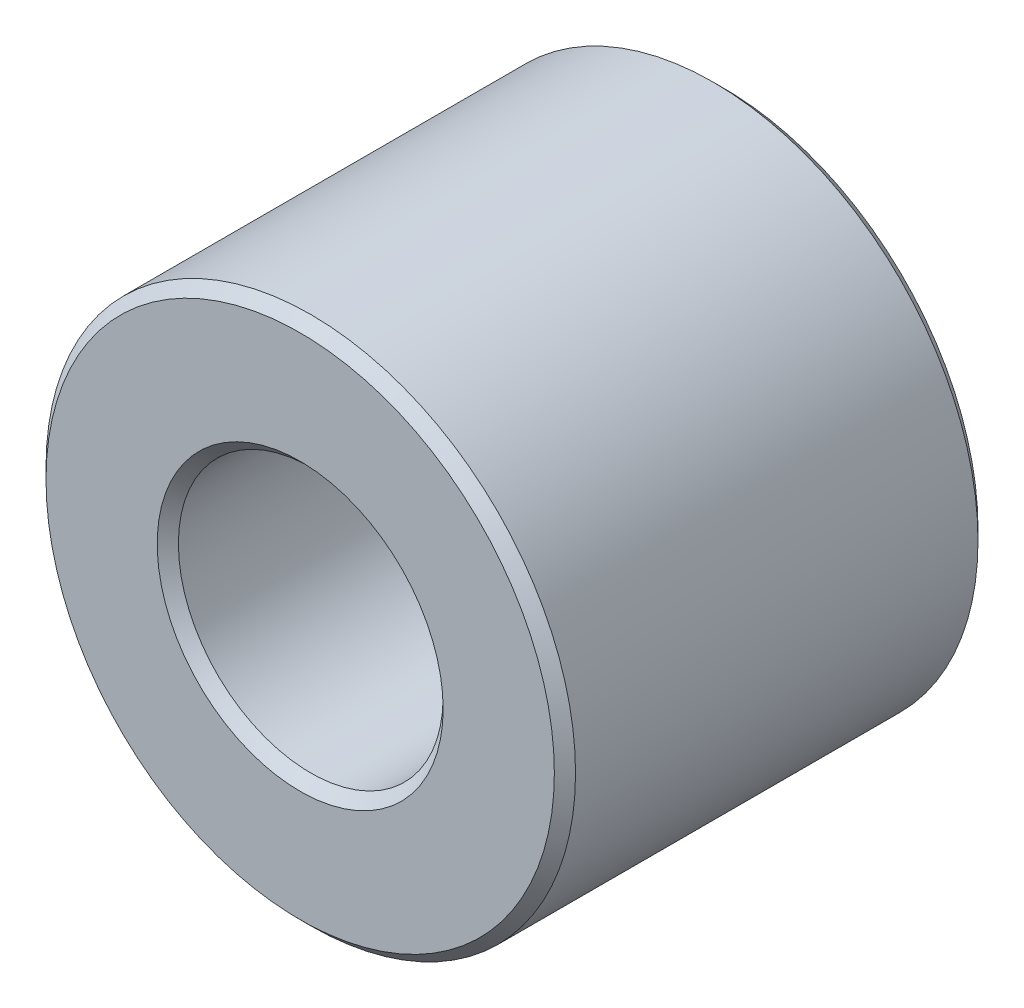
ISO-10303-21;
HEADER;
FILE_DESCRIPTION(('STEP AP214'),'2;1');
FILE_NAME('part.step','',(''),(''),'','','');
FILE_SCHEMA(('AUTOMOTIVE_DESIGN { 1 0 10303 214 1 1 1 1 }'));
ENDSEC;
DATA;
#1=APPLICATION_CONTEXT('core data for automotive mechanical design processes');
#2=APPLICATION_PROTOCOL_DEFINITION('international standard','automotive_design',2000,#1);
#3=PRODUCT_CONTEXT('',#1,'mechanical');
#4=PRODUCT('Part','Part','',(#3));
#5=PRODUCT_RELATED_PRODUCT_CATEGORY('part','',(#4));
#6=PRODUCT_DEFINITION_FORMATION('','',#4);
#7=PRODUCT_DEFINITION_CONTEXT('part definition',#1,'design');
#8=PRODUCT_DEFINITION('design','',#6,#7);
#9=PRODUCT_DEFINITION_SHAPE('','',#8);
#10=(LENGTH_UNIT() NAMED_UNIT(*) SI_UNIT(.MILLI.,.METRE.));
#11=(NAMED_UNIT(*) PLANE_ANGLE_UNIT() SI_UNIT($,.RADIAN.));
#12=(NAMED_UNIT(*) SI_UNIT($,.STERADIAN.) SOLID_ANGLE_UNIT());
#13=UNCERTAINTY_MEASURE_WITH_UNIT(LENGTH_MEASURE(1.E-05),#10,'distance_accuracy_value','');
#14=(GEOMETRIC_REPRESENTATION_CONTEXT(3) GLOBAL_UNCERTAINTY_ASSIGNED_CONTEXT((#13)) GLOBAL_UNIT_ASSIGNED_CONTEXT((#10,
#11,#12)) REPRESENTATION_CONTEXT('',''));
#15=CARTESIAN_POINT('',(0.,0.,0.));
#16=DIRECTION('',(0.,0.,1.));
#17=DIRECTION('',(1.,0.,0.));
#18=AXIS2_PLACEMENT_3D('',#15,#16,#17);
#19=CARTESIAN_POINT('',(0.,0.,2.));
#20=DIRECTION('',(0.,0.,1.));
#21=DIRECTION('',(1.,0.,0.));
#22=AXIS2_PLACEMENT_3D('',#19,#20,#21);
#23=PLANE('',#22);
#24=CARTESIAN_POINT('',(0.,0.,2.));
#25=DIRECTION('',(0.,0.,1.));
#26=DIRECTION('',(1.,0.,0.));
#27=AXIS2_PLACEMENT_3D('',#24,#25,#26);
#28=CIRCLE('',#27,1.35);
#29=CARTESIAN_POINT('',(1.35,0.,2.));
#30=VERTEX_POINT('',#29);
#31=EDGE_CURVE('E10',#30,#30,#28,.F.);
#32=ORIENTED_EDGE('',*,*,#31,.T.);
#33=EDGE_LOOP('',(#32));
#34=FACE_BOUND('',#33,.T.);
#35=CARTESIAN_POINT('',(0.,0.,2.));
#36=DIRECTION('',(0.,0.,1.));
#37=DIRECTION('',(1.,0.,0.));
#38=AXIS2_PLACEMENT_3D('',#35,#36,#37);
#39=CIRCLE('',#38,2.4);
#40=CARTESIAN_POINT('',(2.4,0.,2.));
#41=VERTEX_POINT('',#40);
#42=EDGE_CURVE('E45',#41,#41,#39,.T.);
#43=ORIENTED_EDGE('',*,*,#42,.T.);
#44=EDGE_LOOP('',(#43));
#45=FACE_BOUND('',#44,.T.);
#46=ADVANCED_FACE('F37',(#34,#45),#23,.T.);
#47=CARTESIAN_POINT('',(0.,0.,-2.));
#48=DIRECTION('',(0.,0.,1.));
#49=DIRECTION('',(1.,0.,0.));
#50=AXIS2_PLACEMENT_3D('',#47,#48,#49);
#51=PLANE('',#50);
#52=CARTESIAN_POINT('',(0.,0.,-2.));
#53=DIRECTION('',(0.,0.,1.));
#54=DIRECTION('',(1.,0.,0.));
#55=AXIS2_PLACEMENT_3D('',#52,#53,#54);
#56=CIRCLE('',#55,2.4);
#57=CARTESIAN_POINT('',(2.4,0.,-2.));
#58=VERTEX_POINT('',#57);
#59=EDGE_CURVE('E62',#58,#58,#56,.F.);
#60=ORIENTED_EDGE('',*,*,#59,.T.);
#61=EDGE_LOOP('',(#60));
#62=FACE_BOUND('',#61,.T.);
#63=CARTESIAN_POINT('',(0.,0.,-2.));
#64=DIRECTION('',(0.,0.,1.));
#65=DIRECTION('',(1.,0.,0.));
#66=AXIS2_PLACEMENT_3D('',#63,#64,#65);
#67=CIRCLE('',#66,1.35);
#68=CARTESIAN_POINT('',(1.35,0.,-2.));
#69=VERTEX_POINT('',#68);
#70=EDGE_CURVE('E66',#69,#69,#67,.T.);
#71=ORIENTED_EDGE('',*,*,#70,.T.);
#72=EDGE_LOOP('',(#71));
#73=FACE_BOUND('',#72,.T.);
#74=ADVANCED_FACE('F89',(#62,#73),#51,.F.);
#75=CARTESIAN_POINT('',(0.,0.,2.));
#76=DIRECTION('',(0.,0.,-1.));
#77=DIRECTION('',(-1.,0.,0.));
#78=AXIS2_PLACEMENT_3D('',#75,#76,#77);
#79=CYLINDRICAL_SURFACE('',#78,2.5);
#80=CARTESIAN_POINT('',(0.,0.,-1.9));
#81=DIRECTION('',(0.,0.,1.));
#82=DIRECTION('',(1.,0.,0.));
#83=AXIS2_PLACEMENT_3D('',#80,#81,#82);
#84=CIRCLE('',#83,2.5);
#85=CARTESIAN_POINT('',(2.5,0.,-1.9));
#86=VERTEX_POINT('',#85);
#87=EDGE_CURVE('E69',#86,#86,#84,.T.);
#88=ORIENTED_EDGE('',*,*,#87,.T.);
#89=EDGE_LOOP('',(#88));
#90=FACE_BOUND('',#89,.T.);
#91=CARTESIAN_POINT('',(0.,0.,1.9));
#92=DIRECTION('',(0.,0.,1.));
#93=DIRECTION('',(1.,0.,0.));
#94=AXIS2_PLACEMENT_3D('',#91,#92,#93);
#95=CIRCLE('',#94,2.5);
#96=CARTESIAN_POINT('',(2.5,0.,1.9));
#97=VERTEX_POINT('',#96);
#98=EDGE_CURVE('E73',#97,#97,#95,.F.);
#99=ORIENTED_EDGE('',*,*,#98,.T.);
#100=EDGE_LOOP('',(#99));
#101=FACE_BOUND('',#100,.T.);
#102=ADVANCED_FACE('F78',(#90,#101),#79,.T.);
#103=CARTESIAN_POINT('',(0.,0.,2.));
#104=DIRECTION('',(0.,0.,-1.));
#105=DIRECTION('',(-1.,0.,0.));
#106=AXIS2_PLACEMENT_3D('',#103,#104,#105);
#107=CYLINDRICAL_SURFACE('',#106,1.25);
#108=CARTESIAN_POINT('',(0.,0.,-1.9));
#109=DIRECTION('',(0.,0.,1.));
#110=DIRECTION('',(1.,0.,0.));
#111=AXIS2_PLACEMENT_3D('',#108,#109,#110);
#112=CIRCLE('',#111,1.25);
#113=CARTESIAN_POINT('',(1.25,0.,-1.9));
#114=VERTEX_POINT('',#113);
#115=EDGE_CURVE('E51',#114,#114,#112,.F.);
#116=ORIENTED_EDGE('',*,*,#115,.T.);
#117=EDGE_LOOP('',(#116));
#118=FACE_BOUND('',#117,.T.);
#119=CARTESIAN_POINT('',(0.,0.,1.9));
#120=DIRECTION('',(0.,0.,1.));
#121=DIRECTION('',(1.,0.,0.));
#122=AXIS2_PLACEMENT_3D('',#119,#120,#121);
#123=CIRCLE('',#122,1.25);
#124=CARTESIAN_POINT('',(1.25,0.,1.9));
#125=VERTEX_POINT('',#124);
#126=EDGE_CURVE('E57',#125,#125,#123,.T.);
#127=ORIENTED_EDGE('',*,*,#126,.T.);
#128=EDGE_LOOP('',(#127));
#129=FACE_BOUND('',#128,.T.);
#130=ADVANCED_FACE('F97',(#118,#129),#107,.F.);
#131=CARTESIAN_POINT('',(0.,0.,-1.9));
#132=DIRECTION('',(0.,0.,1.));
#133=DIRECTION('',(1.,0.,0.));
#134=AXIS2_PLACEMENT_3D('',#131,#132,#133);
#135=CONICAL_SURFACE('',#134,2.5,0.78539816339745);
#136=ORIENTED_EDGE('',*,*,#59,.F.);
#137=EDGE_LOOP('',(#136));
#138=FACE_BOUND('',#137,.T.);
#139=ORIENTED_EDGE('',*,*,#87,.F.);
#140=EDGE_LOOP('',(#139));
#141=FACE_BOUND('',#140,.T.);
#142=ADVANCED_FACE('F102',(#138,#141),#135,.T.);
#143=CARTESIAN_POINT('',(0.,0.,-2.));
#144=DIRECTION('',(0.,0.,-1.));
#145=DIRECTION('',(-1.,0.,0.));
#146=AXIS2_PLACEMENT_3D('',#143,#144,#145);
#147=CONICAL_SURFACE('',#146,1.35,0.785398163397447);
#148=ORIENTED_EDGE('',*,*,#115,.F.);
#149=EDGE_LOOP('',(#148));
#150=FACE_BOUND('',#149,.T.);
#151=ORIENTED_EDGE('',*,*,#70,.F.);
#152=EDGE_LOOP('',(#151));
#153=FACE_BOUND('',#152,.T.);
#154=ADVANCED_FACE('F86',(#150,#153),#147,.F.);
#155=CARTESIAN_POINT('',(0.,0.,1.9));
#156=DIRECTION('',(0.,0.,1.));
#157=DIRECTION('',(1.,0.,0.));
#158=AXIS2_PLACEMENT_3D('',#155,#156,#157);
#159=CONICAL_SURFACE('',#158,1.25,0.785398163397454);
#160=ORIENTED_EDGE('',*,*,#31,.F.);
#161=EDGE_LOOP('',(#160));
#162=FACE_BOUND('',#161,.T.);
#163=ORIENTED_EDGE('',*,*,#126,.F.);
#164=EDGE_LOOP('',(#163));
#165=FACE_BOUND('',#164,.T.);
#166=ADVANCED_FACE('F82',(#162,#165),#159,.F.);
#167=CARTESIAN_POINT('',(0.,0.,2.));
#168=DIRECTION('',(0.,0.,-1.));
#169=DIRECTION('',(-1.,0.,0.));
#170=AXIS2_PLACEMENT_3D('',#167,#168,#169);
#171=CONICAL_SURFACE('',#170,2.4,0.785398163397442);
#172=ORIENTED_EDGE('',*,*,#98,.F.);
#173=EDGE_LOOP('',(#172));
#174=FACE_BOUND('',#173,.T.);
#175=ORIENTED_EDGE('',*,*,#42,.F.);
#176=EDGE_LOOP('',(#175));
#177=FACE_BOUND('',#176,.T.);
#178=ADVANCED_FACE('F39',(#174,#177),#171,.T.);
#179=CLOSED_SHELL('',(#46,#74,#102,#130,#142,#154,#166,#178));
#180=MANIFOLD_SOLID_BREP('B2',#179);
#181=ADVANCED_BREP_SHAPE_REPRESENTATION('',(#18,#180),#14);
#182=SHAPE_DEFINITION_REPRESENTATION(#9,#181);
ENDSEC;
END-ISO-10303-21;
